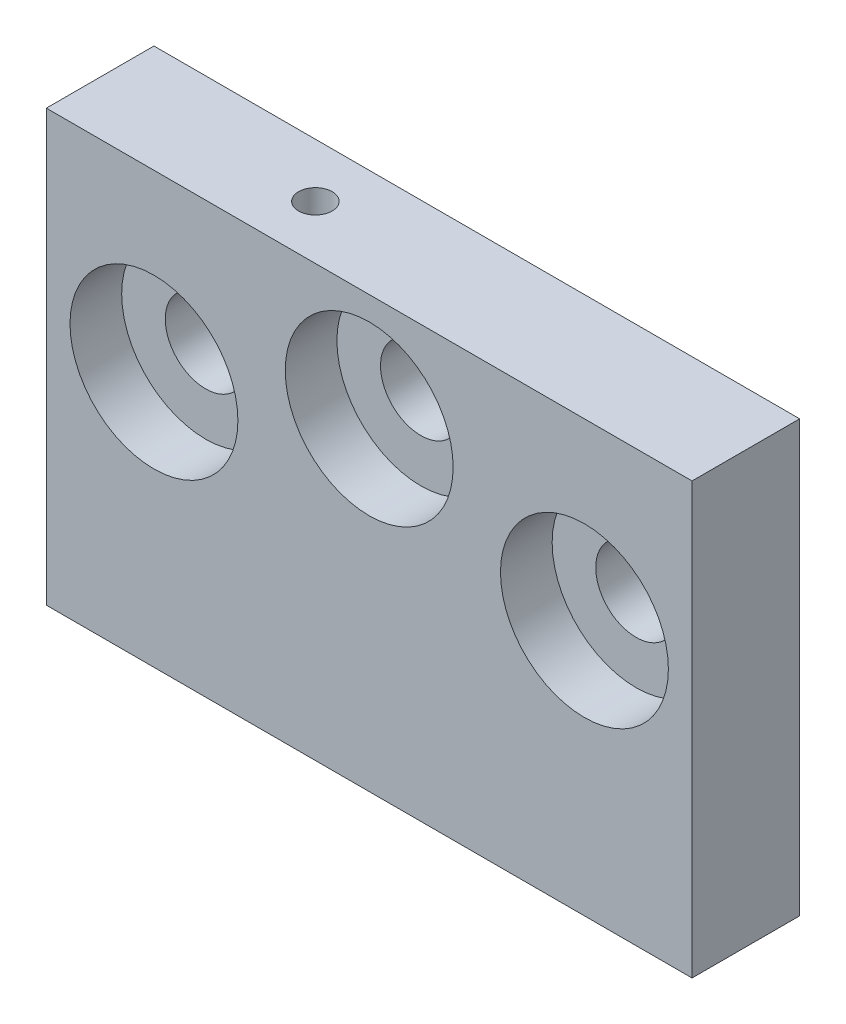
ISO-10303-21;
HEADER;
FILE_DESCRIPTION(('STEP AP214'),'2;1');
FILE_NAME('part.step','',(''),(''),'','','');
FILE_SCHEMA(('AUTOMOTIVE_DESIGN { 1 0 10303 214 1 1 1 1 }'));
ENDSEC;
DATA;
#1=APPLICATION_CONTEXT('core data for automotive mechanical design processes');
#2=APPLICATION_PROTOCOL_DEFINITION('international standard','automotive_design',2000,#1);
#3=PRODUCT_CONTEXT('',#1,'mechanical');
#4=PRODUCT('Part','Part','',(#3));
#5=PRODUCT_RELATED_PRODUCT_CATEGORY('part','',(#4));
#6=PRODUCT_DEFINITION_FORMATION('','',#4);
#7=PRODUCT_DEFINITION_CONTEXT('part definition',#1,'design');
#8=PRODUCT_DEFINITION('design','',#6,#7);
#9=PRODUCT_DEFINITION_SHAPE('','',#8);
#10=(LENGTH_UNIT() NAMED_UNIT(*) SI_UNIT(.MILLI.,.METRE.));
#11=(NAMED_UNIT(*) PLANE_ANGLE_UNIT() SI_UNIT($,.RADIAN.));
#12=(NAMED_UNIT(*) SI_UNIT($,.STERADIAN.) SOLID_ANGLE_UNIT());
#13=UNCERTAINTY_MEASURE_WITH_UNIT(LENGTH_MEASURE(1.E-05),#10,'distance_accuracy_value','');
#14=(GEOMETRIC_REPRESENTATION_CONTEXT(3) GLOBAL_UNCERTAINTY_ASSIGNED_CONTEXT((#13)) GLOBAL_UNIT_ASSIGNED_CONTEXT((#10,
#11,#12)) REPRESENTATION_CONTEXT('',''));
#15=CARTESIAN_POINT('',(0.,0.,0.));
#16=DIRECTION('',(0.,0.,1.));
#17=DIRECTION('',(1.,0.,0.));
#18=AXIS2_PLACEMENT_3D('',#15,#16,#17);
#19=CARTESIAN_POINT('',(-12.7,50.8,-6.35));
#20=DIRECTION('',(0.,-1.,0.));
#21=DIRECTION('',(1.,0.,0.));
#22=AXIS2_PLACEMENT_3D('',#19,#20,#21);
#23=CYLINDRICAL_SURFACE('',#22,1.9812);
#24=CARTESIAN_POINT('',(-12.7,25.4,-6.35));
#25=DIRECTION('',(0.,1.,0.));
#26=DIRECTION('',(-1.,0.,0.));
#27=AXIS2_PLACEMENT_3D('',#24,#25,#26);
#28=CIRCLE('',#27,1.9812);
#29=CARTESIAN_POINT('',(-10.7188,25.4,-6.35));
#30=VERTEX_POINT('',#29);
#31=EDGE_CURVE('E135',#30,#30,#28,.T.);
#32=CARTESIAN_POINT('',(-12.7,-9.52499999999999,-6.35));
#33=DIRECTION('',(0.,-1.,0.));
#34=DIRECTION('',(1.,0.,0.));
#35=AXIS2_PLACEMENT_3D('',#32,#33,#34);
#36=CIRCLE('',#35,1.9812);
#37=CARTESIAN_POINT('',(-10.7188,-9.52499999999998,-6.35));
#38=VERTEX_POINT('',#37);
#39=EDGE_CURVE('E37',#38,#38,#36,.F.);
#40=CARTESIAN_POINT('',(-10.7188,25.4,-6.35));
#41=CARTESIAN_POINT('',(-10.7188,25.0361979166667,-6.35));
#42=CARTESIAN_POINT('',(-10.7188,24.6723958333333,-6.35));
#43=CARTESIAN_POINT('',(-10.7188,23.9447916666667,-6.35));
#44=CARTESIAN_POINT('',(-10.7188,23.5809895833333,-6.35));
#45=CARTESIAN_POINT('',(-10.7188,22.8533854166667,-6.35));
#46=CARTESIAN_POINT('',(-10.7188,22.4895833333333,-6.35));
#47=CARTESIAN_POINT('',(-10.7188,21.7619791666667,-6.35));
#48=CARTESIAN_POINT('',(-10.7188,21.3981770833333,-6.35));
#49=CARTESIAN_POINT('',(-10.7188,20.6705729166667,-6.35));
#50=CARTESIAN_POINT('',(-10.7188,20.3067708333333,-6.35));
#51=CARTESIAN_POINT('',(-10.7188,19.5791666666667,-6.35));
#52=CARTESIAN_POINT('',(-10.7188,19.2153645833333,-6.35));
#53=CARTESIAN_POINT('',(-10.7188,18.4877604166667,-6.35));
#54=CARTESIAN_POINT('',(-10.7188,18.1239583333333,-6.35));
#55=CARTESIAN_POINT('',(-10.7188,17.3963541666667,-6.35));
#56=CARTESIAN_POINT('',(-10.7188,17.0325520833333,-6.35));
#57=CARTESIAN_POINT('',(-10.7188,16.3049479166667,-6.35));
#58=CARTESIAN_POINT('',(-10.7188,15.9411458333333,-6.35));
#59=CARTESIAN_POINT('',(-10.7188,15.2135416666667,-6.35));
#60=CARTESIAN_POINT('',(-10.7188,14.8497395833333,-6.35));
#61=CARTESIAN_POINT('',(-10.7188,14.1221354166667,-6.35));
#62=CARTESIAN_POINT('',(-10.7188,13.7583333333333,-6.35));
#63=CARTESIAN_POINT('',(-10.7188,13.0307291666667,-6.35));
#64=CARTESIAN_POINT('',(-10.7188,12.6669270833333,-6.35));
#65=CARTESIAN_POINT('',(-10.7188,11.9393229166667,-6.35));
#66=CARTESIAN_POINT('',(-10.7188,11.5755208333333,-6.35));
#67=CARTESIAN_POINT('',(-10.7188,10.8479166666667,-6.35));
#68=CARTESIAN_POINT('',(-10.7188,10.4841145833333,-6.35));
#69=CARTESIAN_POINT('',(-10.7188,9.75651041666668,-6.35));
#70=CARTESIAN_POINT('',(-10.7188,9.39270833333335,-6.35));
#71=CARTESIAN_POINT('',(-10.7188,8.66510416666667,-6.35));
#72=CARTESIAN_POINT('',(-10.7188,8.30130208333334,-6.35));
#73=CARTESIAN_POINT('',(-10.7188,7.57369791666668,-6.35));
#74=CARTESIAN_POINT('',(-10.7188,7.20989583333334,-6.35));
#75=CARTESIAN_POINT('',(-10.7188,6.48229166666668,-6.35));
#76=CARTESIAN_POINT('',(-10.7188,6.11848958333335,-6.35));
#77=CARTESIAN_POINT('',(-10.7188,5.39088541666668,-6.35));
#78=CARTESIAN_POINT('',(-10.7188,5.02708333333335,-6.35));
#79=CARTESIAN_POINT('',(-10.7188,4.29947916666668,-6.35));
#80=CARTESIAN_POINT('',(-10.7188,3.93567708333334,-6.35));
#81=CARTESIAN_POINT('',(-10.7188,3.20807291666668,-6.35));
#82=CARTESIAN_POINT('',(-10.7188,2.84427083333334,-6.35));
#83=CARTESIAN_POINT('',(-10.7188,2.11666666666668,-6.35));
#84=CARTESIAN_POINT('',(-10.7188,1.75286458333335,-6.35));
#85=CARTESIAN_POINT('',(-10.7188,1.02526041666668,-6.35));
#86=CARTESIAN_POINT('',(-10.7188,0.661458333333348,-6.35));
#87=CARTESIAN_POINT('',(-10.7188,-0.0661458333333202,-6.35));
#88=CARTESIAN_POINT('',(-10.7188,-0.429947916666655,-6.35));
#89=CARTESIAN_POINT('',(-10.7188,-1.15755208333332,-6.35));
#90=CARTESIAN_POINT('',(-10.7188,-1.52135416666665,-6.35));
#91=CARTESIAN_POINT('',(-10.7188,-2.24895833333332,-6.35));
#92=CARTESIAN_POINT('',(-10.7188,-2.61276041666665,-6.35));
#93=CARTESIAN_POINT('',(-10.7188,-3.34036458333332,-6.35));
#94=CARTESIAN_POINT('',(-10.7188,-3.70416666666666,-6.35));
#95=CARTESIAN_POINT('',(-10.7188,-4.43177083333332,-6.35));
#96=CARTESIAN_POINT('',(-10.7188,-4.79557291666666,-6.35));
#97=CARTESIAN_POINT('',(-10.7188,-5.52317708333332,-6.35));
#98=CARTESIAN_POINT('',(-10.7188,-5.88697916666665,-6.35));
#99=CARTESIAN_POINT('',(-10.7188,-6.61458333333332,-6.35));
#100=CARTESIAN_POINT('',(-10.7188,-6.97838541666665,-6.35));
#101=CARTESIAN_POINT('',(-10.7188,-7.70598958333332,-6.35));
#102=CARTESIAN_POINT('',(-10.7188,-8.06979166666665,-6.35));
#103=CARTESIAN_POINT('',(-10.7188,-8.79739583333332,-6.35));
#104=CARTESIAN_POINT('',(-10.7188,-9.16119791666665,-6.35));
#105=CARTESIAN_POINT('',(-10.7188,-9.52499999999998,-6.35));
#106=B_SPLINE_CURVE_WITH_KNOTS('',3,(#40,#41,#42,#43,#44,#45,#46,#47,#48,#49,#50,#51,#52,#53,
#54,#55,#56,#57,#58,#59,#60,#61,#62,#63,#64,#65,#66,#67,#68,#69,#70,#71,#72,#73,#74,#75,#76,#77,
#78,#79,#80,#81,#82,#83,#84,#85,#86,#87,#88,#89,#90,#91,#92,#93,#94,#95,#96,#97,#98,#99,#100,
#101,#102,#103,#104,#105),.UNSPECIFIED.,.F.,.F.,(4,2,2,2,2,2,2,2,2,2,2,2,2,2,2,2,2,2,2,2,2,2,2,
2,2,2,2,2,2,2,2,2,4),(0.,1.09140625,2.1828125,3.27421875,4.365625,5.45703125,6.54843749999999,
7.63984375,8.73124999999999,9.82265625,10.9140625,12.00546875,13.096875,14.18828125,15.2796875,
16.37109375,17.4625,18.55390625,19.6453125,20.73671875,21.828125,22.91953125,24.0109375,
25.10234375,26.19375,27.28515625,28.3765625,29.46796875,30.559375,31.65078125,32.7421875,
33.83359375,34.925),.UNSPECIFIED.);
#107=EDGE_CURVE('BSEAM33',#30,#38,#106,.T.);
#108=ORIENTED_EDGE('',*,*,#31,.T.);
#109=ORIENTED_EDGE('',*,*,#39,.F.);
#110=ORIENTED_EDGE('',*,*,#107,.T.);
#111=ORIENTED_EDGE('',*,*,#107,.F.);
#112=EDGE_LOOP('',(#108,#110,#109,#111));
#113=FACE_BOUND('',#112,.T.);
#114=ADVANCED_FACE('F33',(#113),#23,.F.);
#115=CARTESIAN_POINT('',(25.4,4.7752,-12.7));
#116=DIRECTION('',(0.,0.,1.));
#117=DIRECTION('',(1.,0.,0.));
#118=AXIS2_PLACEMENT_3D('',#115,#116,#117);
#119=CYLINDRICAL_SURFACE('',#118,4.7625);
#120=CARTESIAN_POINT('',(25.4,4.7752,-12.7));
#121=DIRECTION('',(0.,0.,1.));
#122=DIRECTION('',(1.,0.,0.));
#123=AXIS2_PLACEMENT_3D('',#120,#121,#122);
#124=CIRCLE('',#123,4.7625);
#125=CARTESIAN_POINT('',(30.1625,4.7752,-12.7));
#126=VERTEX_POINT('',#125);
#127=EDGE_CURVE('E115',#126,#126,#124,.T.);
#128=ORIENTED_EDGE('',*,*,#127,.F.);
#129=EDGE_LOOP('',(#128));
#130=FACE_BOUND('',#129,.T.);
#131=CARTESIAN_POINT('',(25.4,4.7752,-6.096));
#132=DIRECTION('',(0.,0.,1.));
#133=DIRECTION('',(1.,0.,0.));
#134=AXIS2_PLACEMENT_3D('',#131,#132,#133);
#135=CIRCLE('',#134,4.7625);
#136=CARTESIAN_POINT('',(30.1625,4.7752,-6.096));
#137=VERTEX_POINT('',#136);
#138=EDGE_CURVE('E121',#137,#137,#135,.F.);
#139=ORIENTED_EDGE('',*,*,#138,.F.);
#140=EDGE_LOOP('',(#139));
#141=FACE_BOUND('',#140,.T.);
#142=ADVANCED_FACE('F178',(#130,#141),#119,.F.);
#143=CARTESIAN_POINT('',(0.,12.7,-12.7));
#144=DIRECTION('',(0.,0.,1.));
#145=DIRECTION('',(1.,0.,0.));
#146=AXIS2_PLACEMENT_3D('',#143,#144,#145);
#147=CYLINDRICAL_SURFACE('',#146,4.7625);
#148=CARTESIAN_POINT('',(0.,12.7,-12.7));
#149=DIRECTION('',(0.,0.,1.));
#150=DIRECTION('',(1.,0.,0.));
#151=AXIS2_PLACEMENT_3D('',#148,#149,#150);
#152=CIRCLE('',#151,4.7625);
#153=CARTESIAN_POINT('',(4.7625,12.7,-12.7));
#154=VERTEX_POINT('',#153);
#155=EDGE_CURVE('E148',#154,#154,#152,.T.);
#156=ORIENTED_EDGE('',*,*,#155,.F.);
#157=EDGE_LOOP('',(#156));
#158=FACE_BOUND('',#157,.T.);
#159=CARTESIAN_POINT('',(0.,12.7,-6.096));
#160=DIRECTION('',(0.,0.,1.));
#161=DIRECTION('',(1.,0.,0.));
#162=AXIS2_PLACEMENT_3D('',#159,#160,#161);
#163=CIRCLE('',#162,4.7625);
#164=CARTESIAN_POINT('',(4.7625,12.7,-6.096));
#165=VERTEX_POINT('',#164);
#166=EDGE_CURVE('E117',#165,#165,#163,.F.);
#167=ORIENTED_EDGE('',*,*,#166,.F.);
#168=EDGE_LOOP('',(#167));
#169=FACE_BOUND('',#168,.T.);
#170=ADVANCED_FACE('F157',(#158,#169),#147,.F.);
#171=CARTESIAN_POINT('',(-25.4,4.7752,-12.7));
#172=DIRECTION('',(0.,0.,1.));
#173=DIRECTION('',(1.,0.,0.));
#174=AXIS2_PLACEMENT_3D('',#171,#172,#173);
#175=CYLINDRICAL_SURFACE('',#174,4.7625);
#176=CARTESIAN_POINT('',(-25.4,4.7752,-12.7));
#177=DIRECTION('',(0.,0.,1.));
#178=DIRECTION('',(1.,0.,0.));
#179=AXIS2_PLACEMENT_3D('',#176,#177,#178);
#180=CIRCLE('',#179,4.7625);
#181=CARTESIAN_POINT('',(-20.6375,4.7752,-12.7));
#182=VERTEX_POINT('',#181);
#183=EDGE_CURVE('E105',#182,#182,#180,.T.);
#184=ORIENTED_EDGE('',*,*,#183,.F.);
#185=EDGE_LOOP('',(#184));
#186=FACE_BOUND('',#185,.T.);
#187=CARTESIAN_POINT('',(-25.4,4.7752,-6.096));
#188=DIRECTION('',(0.,0.,1.));
#189=DIRECTION('',(1.,0.,0.));
#190=AXIS2_PLACEMENT_3D('',#187,#188,#189);
#191=CIRCLE('',#190,4.7625);
#192=CARTESIAN_POINT('',(-20.6375,4.7752,-6.096));
#193=VERTEX_POINT('',#192);
#194=EDGE_CURVE('E112',#193,#193,#191,.F.);
#195=ORIENTED_EDGE('',*,*,#194,.F.);
#196=EDGE_LOOP('',(#195));
#197=FACE_BOUND('',#196,.T.);
#198=ADVANCED_FACE('F154',(#186,#197),#175,.F.);
#199=CARTESIAN_POINT('',(38.1,25.4,-12.7));
#200=DIRECTION('',(0.,1.,0.));
#201=DIRECTION('',(-1.,0.,0.));
#202=AXIS2_PLACEMENT_3D('',#199,#200,#201);
#203=PLANE('',#202);
#204=ORIENTED_EDGE('',*,*,#31,.F.);
#205=EDGE_LOOP('',(#204));
#206=FACE_BOUND('',#205,.T.);
#207=DIRECTION('',(-1.,0.,0.));
#208=VECTOR('',#207,1.);
#209=CARTESIAN_POINT('',(38.1,25.4,0.));
#210=LINE('',#209,#208);
#211=CARTESIAN_POINT('',(38.1,25.4,0.));
#212=VERTEX_POINT('',#211);
#213=CARTESIAN_POINT('',(-38.1,25.4,0.));
#214=VERTEX_POINT('',#213);
#215=EDGE_CURVE('E101',#212,#214,#210,.T.);
#216=ORIENTED_EDGE('',*,*,#215,.F.);
#217=DIRECTION('',(0.,0.,1.));
#218=VECTOR('',#217,1.);
#219=CARTESIAN_POINT('',(38.1,25.4,-12.7));
#220=LINE('',#219,#218);
#221=CARTESIAN_POINT('',(38.1,25.4,-12.7));
#222=VERTEX_POINT('',#221);
#223=EDGE_CURVE('E11',#222,#212,#220,.T.);
#224=ORIENTED_EDGE('',*,*,#223,.F.);
#225=DIRECTION('',(-1.,0.,0.));
#226=VECTOR('',#225,1.);
#227=CARTESIAN_POINT('',(38.1,25.4,-12.7));
#228=LINE('',#227,#226);
#229=CARTESIAN_POINT('',(-38.1,25.4,-12.7));
#230=VERTEX_POINT('',#229);
#231=EDGE_CURVE('E94',#222,#230,#228,.T.);
#232=ORIENTED_EDGE('',*,*,#231,.T.);
#233=DIRECTION('',(0.,0.,1.));
#234=VECTOR('',#233,1.);
#235=CARTESIAN_POINT('',(-38.1,25.4,-12.7));
#236=LINE('',#235,#234);
#237=EDGE_CURVE('E77',#230,#214,#236,.T.);
#238=ORIENTED_EDGE('',*,*,#237,.T.);
#239=EDGE_LOOP('',(#216,#224,#232,#238));
#240=FACE_BOUND('',#239,.T.);
#241=ADVANCED_FACE('F35',(#206,#240),#203,.T.);
#242=CARTESIAN_POINT('',(38.1,25.4,-12.7));
#243=DIRECTION('',(1.,0.,0.));
#244=DIRECTION('',(0.,1.,0.));
#245=AXIS2_PLACEMENT_3D('',#242,#243,#244);
#246=PLANE('',#245);
#247=DIRECTION('',(0.,1.,0.));
#248=VECTOR('',#247,1.);
#249=CARTESIAN_POINT('',(38.1,25.4,0.));
#250=LINE('',#249,#248);
#251=CARTESIAN_POINT('',(38.1,-25.4,0.));
#252=VERTEX_POINT('',#251);
#253=EDGE_CURVE('E96',#252,#212,#250,.T.);
#254=ORIENTED_EDGE('',*,*,#253,.F.);
#255=DIRECTION('',(0.,0.,1.));
#256=VECTOR('',#255,1.);
#257=CARTESIAN_POINT('',(38.1,-25.4,-12.7));
#258=LINE('',#257,#256);
#259=CARTESIAN_POINT('',(38.1,-25.4,-12.7));
#260=VERTEX_POINT('',#259);
#261=EDGE_CURVE('E43',#260,#252,#258,.T.);
#262=ORIENTED_EDGE('',*,*,#261,.F.);
#263=DIRECTION('',(0.,1.,0.));
#264=VECTOR('',#263,1.);
#265=CARTESIAN_POINT('',(38.1,25.4,-12.7));
#266=LINE('',#265,#264);
#267=EDGE_CURVE('E91',#260,#222,#266,.T.);
#268=ORIENTED_EDGE('',*,*,#267,.T.);
#269=ORIENTED_EDGE('',*,*,#223,.T.);
#270=EDGE_LOOP('',(#254,#262,#268,#269));
#271=FACE_BOUND('',#270,.T.);
#272=ADVANCED_FACE('F214',(#271),#246,.T.);
#273=CARTESIAN_POINT('',(38.1,-25.4,-12.7));
#274=DIRECTION('',(0.,-1.,0.));
#275=DIRECTION('',(1.,0.,0.));
#276=AXIS2_PLACEMENT_3D('',#273,#274,#275);
#277=PLANE('',#276);
#278=CARTESIAN_POINT('',(-12.7,-25.4,-6.35));
#279=DIRECTION('',(0.,-1.,0.));
#280=DIRECTION('',(1.,0.,0.));
#281=AXIS2_PLACEMENT_3D('',#278,#279,#280);
#282=CIRCLE('',#281,2.9718);
#283=CARTESIAN_POINT('',(-9.72820000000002,-25.4,-6.35));
#284=VERTEX_POINT('',#283);
#285=EDGE_CURVE('E295',#284,#284,#282,.T.);
#286=ORIENTED_EDGE('',*,*,#285,.F.);
#287=EDGE_LOOP('',(#286));
#288=FACE_BOUND('',#287,.T.);
#289=DIRECTION('',(1.,0.,0.));
#290=VECTOR('',#289,1.);
#291=CARTESIAN_POINT('',(38.1,-25.4,0.));
#292=LINE('',#291,#290);
#293=CARTESIAN_POINT('',(-38.1,-25.4,0.));
#294=VERTEX_POINT('',#293);
#295=EDGE_CURVE('E85',#294,#252,#292,.T.);
#296=ORIENTED_EDGE('',*,*,#295,.F.);
#297=DIRECTION('',(0.,0.,1.));
#298=VECTOR('',#297,1.);
#299=CARTESIAN_POINT('',(-38.1,-25.4,-12.7));
#300=LINE('',#299,#298);
#301=CARTESIAN_POINT('',(-38.1,-25.4,-12.7));
#302=VERTEX_POINT('',#301);
#303=EDGE_CURVE('E80',#302,#294,#300,.T.);
#304=ORIENTED_EDGE('',*,*,#303,.F.);
#305=DIRECTION('',(1.,0.,0.));
#306=VECTOR('',#305,1.);
#307=CARTESIAN_POINT('',(38.1,-25.4,-12.7));
#308=LINE('',#307,#306);
#309=EDGE_CURVE('E83',#302,#260,#308,.T.);
#310=ORIENTED_EDGE('',*,*,#309,.T.);
#311=ORIENTED_EDGE('',*,*,#261,.T.);
#312=EDGE_LOOP('',(#296,#304,#310,#311));
#313=FACE_BOUND('',#312,.T.);
#314=ADVANCED_FACE('F82',(#288,#313),#277,.T.);
#315=CARTESIAN_POINT('',(-38.1,25.4,-12.7));
#316=DIRECTION('',(-1.,0.,0.));
#317=DIRECTION('',(0.,-1.,0.));
#318=AXIS2_PLACEMENT_3D('',#315,#316,#317);
#319=PLANE('',#318);
#320=DIRECTION('',(0.,-1.,0.));
#321=VECTOR('',#320,1.);
#322=CARTESIAN_POINT('',(-38.1,25.4,0.));
#323=LINE('',#322,#321);
#324=EDGE_CURVE('E104',#214,#294,#323,.T.);
#325=ORIENTED_EDGE('',*,*,#324,.F.);
#326=ORIENTED_EDGE('',*,*,#237,.F.);
#327=DIRECTION('',(0.,-1.,0.));
#328=VECTOR('',#327,1.);
#329=CARTESIAN_POINT('',(-38.1,25.4,-12.7));
#330=LINE('',#329,#328);
#331=EDGE_CURVE('E90',#230,#302,#330,.T.);
#332=ORIENTED_EDGE('',*,*,#331,.T.);
#333=ORIENTED_EDGE('',*,*,#303,.T.);
#334=EDGE_LOOP('',(#325,#326,#332,#333));
#335=FACE_BOUND('',#334,.T.);
#336=ADVANCED_FACE('F93',(#335),#319,.T.);
#337=CARTESIAN_POINT('',(0.,0.,-12.7));
#338=DIRECTION('',(0.,0.,1.));
#339=DIRECTION('',(1.,0.,0.));
#340=AXIS2_PLACEMENT_3D('',#337,#338,#339);
#341=PLANE('',#340);
#342=ORIENTED_EDGE('',*,*,#127,.T.);
#343=EDGE_LOOP('',(#342));
#344=FACE_BOUND('',#343,.T.);
#345=ORIENTED_EDGE('',*,*,#155,.T.);
#346=EDGE_LOOP('',(#345));
#347=FACE_BOUND('',#346,.T.);
#348=ORIENTED_EDGE('',*,*,#183,.T.);
#349=EDGE_LOOP('',(#348));
#350=FACE_BOUND('',#349,.T.);
#351=ORIENTED_EDGE('',*,*,#231,.F.);
#352=ORIENTED_EDGE('',*,*,#267,.F.);
#353=ORIENTED_EDGE('',*,*,#309,.F.);
#354=ORIENTED_EDGE('',*,*,#331,.F.);
#355=EDGE_LOOP('',(#351,#352,#353,#354));
#356=FACE_BOUND('',#355,.T.);
#357=ADVANCED_FACE('F89',(#344,#347,#350,#356),#341,.F.);
#358=CARTESIAN_POINT('',(0.,0.,0.));
#359=DIRECTION('',(0.,0.,1.));
#360=DIRECTION('',(1.,0.,0.));
#361=AXIS2_PLACEMENT_3D('',#358,#359,#360);
#362=PLANE('',#361);
#363=CARTESIAN_POINT('',(25.4,4.7752,0.));
#364=DIRECTION('',(0.,0.,1.));
#365=DIRECTION('',(1.,0.,0.));
#366=AXIS2_PLACEMENT_3D('',#363,#364,#365);
#367=CIRCLE('',#366,9.90600000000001);
#368=CARTESIAN_POINT('',(35.306,4.7752,0.));
#369=VERTEX_POINT('',#368);
#370=EDGE_CURVE('E130',#369,#369,#367,.T.);
#371=ORIENTED_EDGE('',*,*,#370,.F.);
#372=EDGE_LOOP('',(#371));
#373=FACE_BOUND('',#372,.T.);
#374=CARTESIAN_POINT('',(0.,12.7,0.));
#375=DIRECTION('',(0.,0.,1.));
#376=DIRECTION('',(1.,0.,0.));
#377=AXIS2_PLACEMENT_3D('',#374,#375,#376);
#378=CIRCLE('',#377,9.906);
#379=CARTESIAN_POINT('',(9.906,12.7,0.));
#380=VERTEX_POINT('',#379);
#381=EDGE_CURVE('E123',#380,#380,#378,.T.);
#382=ORIENTED_EDGE('',*,*,#381,.F.);
#383=EDGE_LOOP('',(#382));
#384=FACE_BOUND('',#383,.T.);
#385=CARTESIAN_POINT('',(-25.4,4.7752,0.));
#386=DIRECTION('',(0.,0.,1.));
#387=DIRECTION('',(1.,0.,0.));
#388=AXIS2_PLACEMENT_3D('',#385,#386,#387);
#389=CIRCLE('',#388,9.906);
#390=CARTESIAN_POINT('',(-15.494,4.7752,0.));
#391=VERTEX_POINT('',#390);
#392=EDGE_CURVE('E119',#391,#391,#389,.T.);
#393=ORIENTED_EDGE('',*,*,#392,.F.);
#394=EDGE_LOOP('',(#393));
#395=FACE_BOUND('',#394,.T.);
#396=ORIENTED_EDGE('',*,*,#215,.T.);
#397=ORIENTED_EDGE('',*,*,#324,.T.);
#398=ORIENTED_EDGE('',*,*,#295,.T.);
#399=ORIENTED_EDGE('',*,*,#253,.T.);
#400=EDGE_LOOP('',(#396,#397,#398,#399));
#401=FACE_BOUND('',#400,.T.);
#402=ADVANCED_FACE('F164',(#373,#384,#395,#401),#362,.T.);
#403=CARTESIAN_POINT('',(-25.4,4.7752,-6.096));
#404=DIRECTION('',(0.,0.,1.));
#405=DIRECTION('',(1.,0.,0.));
#406=AXIS2_PLACEMENT_3D('',#403,#404,#405);
#407=PLANE('',#406);
#408=CARTESIAN_POINT('',(-25.4,4.7752,-6.096));
#409=DIRECTION('',(0.,0.,1.));
#410=DIRECTION('',(1.,0.,0.));
#411=AXIS2_PLACEMENT_3D('',#408,#409,#410);
#412=CIRCLE('',#411,9.906);
#413=CARTESIAN_POINT('',(-15.494,4.7752,-6.096));
#414=VERTEX_POINT('',#413);
#415=EDGE_CURVE('E116',#414,#414,#412,.T.);
#416=ORIENTED_EDGE('',*,*,#415,.T.);
#417=EDGE_LOOP('',(#416));
#418=FACE_BOUND('',#417,.T.);
#419=ORIENTED_EDGE('',*,*,#194,.T.);
#420=EDGE_LOOP('',(#419));
#421=FACE_BOUND('',#420,.T.);
#422=ADVANCED_FACE('F161',(#418,#421),#407,.T.);
#423=CARTESIAN_POINT('',(-25.4,4.7752,-6.096));
#424=DIRECTION('',(0.,0.,1.));
#425=DIRECTION('',(1.,0.,0.));
#426=AXIS2_PLACEMENT_3D('',#423,#424,#425);
#427=CYLINDRICAL_SURFACE('',#426,9.906);
#428=CARTESIAN_POINT('',(-15.494,4.7752,-6.096));
#429=CARTESIAN_POINT('',(-15.494,4.7752,-6.0325));
#430=CARTESIAN_POINT('',(-15.494,4.7752,-5.969));
#431=CARTESIAN_POINT('',(-15.494,4.7752,-5.842));
#432=CARTESIAN_POINT('',(-15.494,4.7752,-5.7785));
#433=CARTESIAN_POINT('',(-15.494,4.7752,-5.6515));
#434=CARTESIAN_POINT('',(-15.494,4.7752,-5.588));
#435=CARTESIAN_POINT('',(-15.494,4.7752,-5.461));
#436=CARTESIAN_POINT('',(-15.494,4.7752,-5.3975));
#437=CARTESIAN_POINT('',(-15.494,4.7752,-5.2705));
#438=CARTESIAN_POINT('',(-15.494,4.7752,-5.207));
#439=CARTESIAN_POINT('',(-15.494,4.7752,-5.08));
#440=CARTESIAN_POINT('',(-15.494,4.7752,-5.0165));
#441=CARTESIAN_POINT('',(-15.494,4.7752,-4.8895));
#442=CARTESIAN_POINT('',(-15.494,4.7752,-4.826));
#443=CARTESIAN_POINT('',(-15.494,4.7752,-4.699));
#444=CARTESIAN_POINT('',(-15.494,4.7752,-4.6355));
#445=CARTESIAN_POINT('',(-15.494,4.7752,-4.5085));
#446=CARTESIAN_POINT('',(-15.494,4.7752,-4.445));
#447=CARTESIAN_POINT('',(-15.494,4.7752,-4.318));
#448=CARTESIAN_POINT('',(-15.494,4.7752,-4.2545));
#449=CARTESIAN_POINT('',(-15.494,4.7752,-4.1275));
#450=CARTESIAN_POINT('',(-15.494,4.7752,-4.064));
#451=CARTESIAN_POINT('',(-15.494,4.7752,-3.937));
#452=CARTESIAN_POINT('',(-15.494,4.7752,-3.8735));
#453=CARTESIAN_POINT('',(-15.494,4.7752,-3.7465));
#454=CARTESIAN_POINT('',(-15.494,4.7752,-3.683));
#455=CARTESIAN_POINT('',(-15.494,4.7752,-3.556));
#456=CARTESIAN_POINT('',(-15.494,4.7752,-3.4925));
#457=CARTESIAN_POINT('',(-15.494,4.7752,-3.3655));
#458=CARTESIAN_POINT('',(-15.494,4.7752,-3.302));
#459=CARTESIAN_POINT('',(-15.494,4.7752,-3.175));
#460=CARTESIAN_POINT('',(-15.494,4.7752,-3.1115));
#461=CARTESIAN_POINT('',(-15.494,4.7752,-2.9845));
#462=CARTESIAN_POINT('',(-15.494,4.7752,-2.921));
#463=CARTESIAN_POINT('',(-15.494,4.7752,-2.794));
#464=CARTESIAN_POINT('',(-15.494,4.7752,-2.7305));
#465=CARTESIAN_POINT('',(-15.494,4.7752,-2.6035));
#466=CARTESIAN_POINT('',(-15.494,4.7752,-2.54));
#467=CARTESIAN_POINT('',(-15.494,4.7752,-2.413));
#468=CARTESIAN_POINT('',(-15.494,4.7752,-2.3495));
#469=CARTESIAN_POINT('',(-15.494,4.7752,-2.2225));
#470=CARTESIAN_POINT('',(-15.494,4.7752,-2.159));
#471=CARTESIAN_POINT('',(-15.494,4.7752,-2.032));
#472=CARTESIAN_POINT('',(-15.494,4.7752,-1.9685));
#473=CARTESIAN_POINT('',(-15.494,4.7752,-1.8415));
#474=CARTESIAN_POINT('',(-15.494,4.7752,-1.778));
#475=CARTESIAN_POINT('',(-15.494,4.7752,-1.651));
#476=CARTESIAN_POINT('',(-15.494,4.7752,-1.5875));
#477=CARTESIAN_POINT('',(-15.494,4.7752,-1.4605));
#478=CARTESIAN_POINT('',(-15.494,4.7752,-1.397));
#479=CARTESIAN_POINT('',(-15.494,4.7752,-1.27));
#480=CARTESIAN_POINT('',(-15.494,4.7752,-1.2065));
#481=CARTESIAN_POINT('',(-15.494,4.7752,-1.0795));
#482=CARTESIAN_POINT('',(-15.494,4.7752,-1.016));
#483=CARTESIAN_POINT('',(-15.494,4.7752,-0.889));
#484=CARTESIAN_POINT('',(-15.494,4.7752,-0.8255));
#485=CARTESIAN_POINT('',(-15.494,4.7752,-0.6985));
#486=CARTESIAN_POINT('',(-15.494,4.7752,-0.635));
#487=CARTESIAN_POINT('',(-15.494,4.7752,-0.508));
#488=CARTESIAN_POINT('',(-15.494,4.7752,-0.4445));
#489=CARTESIAN_POINT('',(-15.494,4.7752,-0.3175));
#490=CARTESIAN_POINT('',(-15.494,4.7752,-0.254));
#491=CARTESIAN_POINT('',(-15.494,4.7752,-0.127));
#492=CARTESIAN_POINT('',(-15.494,4.7752,-0.0634999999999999));
#493=CARTESIAN_POINT('',(-15.494,4.7752,0.));
#494=B_SPLINE_CURVE_WITH_KNOTS('',3,(#428,#429,#430,#431,#432,#433,#434,#435,#436,#437,#438,
#439,#440,#441,#442,#443,#444,#445,#446,#447,#448,#449,#450,#451,#452,#453,#454,#455,#456,#457,
#458,#459,#460,#461,#462,#463,#464,#465,#466,#467,#468,#469,#470,#471,#472,#473,#474,#475,#476,
#477,#478,#479,#480,#481,#482,#483,#484,#485,#486,#487,#488,#489,#490,#491,#492,#493),
.UNSPECIFIED.,.F.,.F.,(4,2,2,2,2,2,2,2,2,2,2,2,2,2,2,2,2,2,2,2,2,2,2,2,2,2,2,2,2,2,2,2,4),(0.,
0.190500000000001,0.381,0.571500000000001,0.762000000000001,0.9525,1.143,1.3335,1.524,1.7145,
1.905,2.0955,2.286,2.4765,2.667,2.8575,3.048,3.2385,3.429,3.6195,3.81,4.0005,4.191,4.3815,4.572,
4.7625,4.953,5.1435,5.334,5.5245,5.715,5.9055,6.096),.UNSPECIFIED.);
#495=EDGE_CURVE('BSEAM163',#414,#391,#494,.T.);
#496=ORIENTED_EDGE('',*,*,#415,.F.);
#497=ORIENTED_EDGE('',*,*,#392,.T.);
#498=ORIENTED_EDGE('',*,*,#495,.T.);
#499=ORIENTED_EDGE('',*,*,#495,.F.);
#500=EDGE_LOOP('',(#496,#498,#497,#499));
#501=FACE_BOUND('',#500,.T.);
#502=ADVANCED_FACE('F163',(#501),#427,.F.);
#503=CARTESIAN_POINT('',(0.,12.7,-6.096));
#504=DIRECTION('',(0.,0.,1.));
#505=DIRECTION('',(1.,0.,0.));
#506=AXIS2_PLACEMENT_3D('',#503,#504,#505);
#507=PLANE('',#506);
#508=CARTESIAN_POINT('',(0.,12.7,-6.096));
#509=DIRECTION('',(0.,0.,1.));
#510=DIRECTION('',(1.,0.,0.));
#511=AXIS2_PLACEMENT_3D('',#508,#509,#510);
#512=CIRCLE('',#511,9.906);
#513=CARTESIAN_POINT('',(9.906,12.7,-6.096));
#514=VERTEX_POINT('',#513);
#515=EDGE_CURVE('E120',#514,#514,#512,.T.);
#516=ORIENTED_EDGE('',*,*,#515,.T.);
#517=EDGE_LOOP('',(#516));
#518=FACE_BOUND('',#517,.T.);
#519=ORIENTED_EDGE('',*,*,#166,.T.);
#520=EDGE_LOOP('',(#519));
#521=FACE_BOUND('',#520,.T.);
#522=ADVANCED_FACE('F171',(#518,#521),#507,.T.);
#523=CARTESIAN_POINT('',(0.,12.7,-6.096));
#524=DIRECTION('',(0.,0.,1.));
#525=DIRECTION('',(1.,0.,0.));
#526=AXIS2_PLACEMENT_3D('',#523,#524,#525);
#527=CYLINDRICAL_SURFACE('',#526,9.906);
#528=CARTESIAN_POINT('',(9.906,12.7,-6.096));
#529=CARTESIAN_POINT('',(9.906,12.7,-6.0325));
#530=CARTESIAN_POINT('',(9.906,12.7,-5.969));
#531=CARTESIAN_POINT('',(9.906,12.7,-5.842));
#532=CARTESIAN_POINT('',(9.906,12.7,-5.7785));
#533=CARTESIAN_POINT('',(9.906,12.7,-5.6515));
#534=CARTESIAN_POINT('',(9.906,12.7,-5.588));
#535=CARTESIAN_POINT('',(9.906,12.7,-5.461));
#536=CARTESIAN_POINT('',(9.906,12.7,-5.3975));
#537=CARTESIAN_POINT('',(9.906,12.7,-5.2705));
#538=CARTESIAN_POINT('',(9.906,12.7,-5.207));
#539=CARTESIAN_POINT('',(9.906,12.7,-5.08));
#540=CARTESIAN_POINT('',(9.906,12.7,-5.0165));
#541=CARTESIAN_POINT('',(9.906,12.7,-4.8895));
#542=CARTESIAN_POINT('',(9.906,12.7,-4.826));
#543=CARTESIAN_POINT('',(9.906,12.7,-4.699));
#544=CARTESIAN_POINT('',(9.906,12.7,-4.6355));
#545=CARTESIAN_POINT('',(9.906,12.7,-4.5085));
#546=CARTESIAN_POINT('',(9.906,12.7,-4.445));
#547=CARTESIAN_POINT('',(9.906,12.7,-4.318));
#548=CARTESIAN_POINT('',(9.906,12.7,-4.2545));
#549=CARTESIAN_POINT('',(9.906,12.7,-4.1275));
#550=CARTESIAN_POINT('',(9.906,12.7,-4.064));
#551=CARTESIAN_POINT('',(9.906,12.7,-3.937));
#552=CARTESIAN_POINT('',(9.906,12.7,-3.8735));
#553=CARTESIAN_POINT('',(9.906,12.7,-3.7465));
#554=CARTESIAN_POINT('',(9.906,12.7,-3.683));
#555=CARTESIAN_POINT('',(9.906,12.7,-3.556));
#556=CARTESIAN_POINT('',(9.906,12.7,-3.4925));
#557=CARTESIAN_POINT('',(9.906,12.7,-3.3655));
#558=CARTESIAN_POINT('',(9.906,12.7,-3.302));
#559=CARTESIAN_POINT('',(9.906,12.7,-3.175));
#560=CARTESIAN_POINT('',(9.906,12.7,-3.1115));
#561=CARTESIAN_POINT('',(9.906,12.7,-2.9845));
#562=CARTESIAN_POINT('',(9.906,12.7,-2.921));
#563=CARTESIAN_POINT('',(9.906,12.7,-2.794));
#564=CARTESIAN_POINT('',(9.906,12.7,-2.7305));
#565=CARTESIAN_POINT('',(9.906,12.7,-2.6035));
#566=CARTESIAN_POINT('',(9.906,12.7,-2.54));
#567=CARTESIAN_POINT('',(9.906,12.7,-2.413));
#568=CARTESIAN_POINT('',(9.906,12.7,-2.3495));
#569=CARTESIAN_POINT('',(9.906,12.7,-2.2225));
#570=CARTESIAN_POINT('',(9.906,12.7,-2.159));
#571=CARTESIAN_POINT('',(9.906,12.7,-2.032));
#572=CARTESIAN_POINT('',(9.906,12.7,-1.9685));
#573=CARTESIAN_POINT('',(9.906,12.7,-1.8415));
#574=CARTESIAN_POINT('',(9.906,12.7,-1.778));
#575=CARTESIAN_POINT('',(9.906,12.7,-1.651));
#576=CARTESIAN_POINT('',(9.906,12.7,-1.5875));
#577=CARTESIAN_POINT('',(9.906,12.7,-1.4605));
#578=CARTESIAN_POINT('',(9.906,12.7,-1.397));
#579=CARTESIAN_POINT('',(9.906,12.7,-1.27));
#580=CARTESIAN_POINT('',(9.906,12.7,-1.2065));
#581=CARTESIAN_POINT('',(9.906,12.7,-1.0795));
#582=CARTESIAN_POINT('',(9.906,12.7,-1.016));
#583=CARTESIAN_POINT('',(9.906,12.7,-0.889));
#584=CARTESIAN_POINT('',(9.906,12.7,-0.8255));
#585=CARTESIAN_POINT('',(9.906,12.7,-0.6985));
#586=CARTESIAN_POINT('',(9.906,12.7,-0.635));
#587=CARTESIAN_POINT('',(9.906,12.7,-0.508));
#588=CARTESIAN_POINT('',(9.906,12.7,-0.4445));
#589=CARTESIAN_POINT('',(9.906,12.7,-0.3175));
#590=CARTESIAN_POINT('',(9.906,12.7,-0.254));
#591=CARTESIAN_POINT('',(9.906,12.7,-0.127));
#592=CARTESIAN_POINT('',(9.906,12.7,-0.0634999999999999));
#593=CARTESIAN_POINT('',(9.906,12.7,0.));
#594=B_SPLINE_CURVE_WITH_KNOTS('',3,(#528,#529,#530,#531,#532,#533,#534,#535,#536,#537,#538,
#539,#540,#541,#542,#543,#544,#545,#546,#547,#548,#549,#550,#551,#552,#553,#554,#555,#556,#557,
#558,#559,#560,#561,#562,#563,#564,#565,#566,#567,#568,#569,#570,#571,#572,#573,#574,#575,#576,
#577,#578,#579,#580,#581,#582,#583,#584,#585,#586,#587,#588,#589,#590,#591,#592,#593),
.UNSPECIFIED.,.F.,.F.,(4,2,2,2,2,2,2,2,2,2,2,2,2,2,2,2,2,2,2,2,2,2,2,2,2,2,2,2,2,2,2,2,4),(0.,
0.190500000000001,0.381,0.571500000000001,0.762000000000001,0.9525,1.143,1.3335,1.524,1.7145,
1.905,2.0955,2.286,2.4765,2.667,2.8575,3.048,3.2385,3.429,3.6195,3.81,4.0005,4.191,4.3815,4.572,
4.7625,4.953,5.1435,5.334,5.5245,5.715,5.9055,6.096),.UNSPECIFIED.);
#595=EDGE_CURVE('BSEAM196',#514,#380,#594,.T.);
#596=ORIENTED_EDGE('',*,*,#515,.F.);
#597=ORIENTED_EDGE('',*,*,#381,.T.);
#598=ORIENTED_EDGE('',*,*,#595,.T.);
#599=ORIENTED_EDGE('',*,*,#595,.F.);
#600=EDGE_LOOP('',(#596,#598,#597,#599));
#601=FACE_BOUND('',#600,.T.);
#602=ADVANCED_FACE('F196',(#601),#527,.F.);
#603=CARTESIAN_POINT('',(25.4,4.7752,-6.096));
#604=DIRECTION('',(0.,0.,1.));
#605=DIRECTION('',(1.,0.,0.));
#606=AXIS2_PLACEMENT_3D('',#603,#604,#605);
#607=PLANE('',#606);
#608=CARTESIAN_POINT('',(25.4,4.7752,-6.096));
#609=DIRECTION('',(0.,0.,1.));
#610=DIRECTION('',(1.,0.,0.));
#611=AXIS2_PLACEMENT_3D('',#608,#609,#610);
#612=CIRCLE('',#611,9.90600000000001);
#613=CARTESIAN_POINT('',(35.306,4.7752,-6.096));
#614=VERTEX_POINT('',#613);
#615=EDGE_CURVE('E124',#614,#614,#612,.T.);
#616=ORIENTED_EDGE('',*,*,#615,.T.);
#617=EDGE_LOOP('',(#616));
#618=FACE_BOUND('',#617,.T.);
#619=ORIENTED_EDGE('',*,*,#138,.T.);
#620=EDGE_LOOP('',(#619));
#621=FACE_BOUND('',#620,.T.);
#622=ADVANCED_FACE('F192',(#618,#621),#607,.T.);
#623=CARTESIAN_POINT('',(25.4,4.7752,-6.096));
#624=DIRECTION('',(0.,0.,1.));
#625=DIRECTION('',(1.,0.,0.));
#626=AXIS2_PLACEMENT_3D('',#623,#624,#625);
#627=CYLINDRICAL_SURFACE('',#626,9.90600000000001);
#628=CARTESIAN_POINT('',(35.306,4.7752,-6.096));
#629=CARTESIAN_POINT('',(35.306,4.7752,-6.0325));
#630=CARTESIAN_POINT('',(35.306,4.7752,-5.969));
#631=CARTESIAN_POINT('',(35.306,4.7752,-5.842));
#632=CARTESIAN_POINT('',(35.306,4.7752,-5.7785));
#633=CARTESIAN_POINT('',(35.306,4.7752,-5.6515));
#634=CARTESIAN_POINT('',(35.306,4.7752,-5.588));
#635=CARTESIAN_POINT('',(35.306,4.7752,-5.461));
#636=CARTESIAN_POINT('',(35.306,4.7752,-5.3975));
#637=CARTESIAN_POINT('',(35.306,4.7752,-5.2705));
#638=CARTESIAN_POINT('',(35.306,4.7752,-5.207));
#639=CARTESIAN_POINT('',(35.306,4.7752,-5.08));
#640=CARTESIAN_POINT('',(35.306,4.7752,-5.0165));
#641=CARTESIAN_POINT('',(35.306,4.7752,-4.8895));
#642=CARTESIAN_POINT('',(35.306,4.7752,-4.826));
#643=CARTESIAN_POINT('',(35.306,4.7752,-4.699));
#644=CARTESIAN_POINT('',(35.306,4.7752,-4.6355));
#645=CARTESIAN_POINT('',(35.306,4.7752,-4.5085));
#646=CARTESIAN_POINT('',(35.306,4.7752,-4.445));
#647=CARTESIAN_POINT('',(35.306,4.7752,-4.318));
#648=CARTESIAN_POINT('',(35.306,4.7752,-4.2545));
#649=CARTESIAN_POINT('',(35.306,4.7752,-4.1275));
#650=CARTESIAN_POINT('',(35.306,4.7752,-4.064));
#651=CARTESIAN_POINT('',(35.306,4.7752,-3.937));
#652=CARTESIAN_POINT('',(35.306,4.7752,-3.8735));
#653=CARTESIAN_POINT('',(35.306,4.7752,-3.7465));
#654=CARTESIAN_POINT('',(35.306,4.7752,-3.683));
#655=CARTESIAN_POINT('',(35.306,4.7752,-3.556));
#656=CARTESIAN_POINT('',(35.306,4.7752,-3.4925));
#657=CARTESIAN_POINT('',(35.306,4.7752,-3.3655));
#658=CARTESIAN_POINT('',(35.306,4.7752,-3.302));
#659=CARTESIAN_POINT('',(35.306,4.7752,-3.175));
#660=CARTESIAN_POINT('',(35.306,4.7752,-3.1115));
#661=CARTESIAN_POINT('',(35.306,4.7752,-2.9845));
#662=CARTESIAN_POINT('',(35.306,4.7752,-2.921));
#663=CARTESIAN_POINT('',(35.306,4.7752,-2.794));
#664=CARTESIAN_POINT('',(35.306,4.7752,-2.7305));
#665=CARTESIAN_POINT('',(35.306,4.7752,-2.6035));
#666=CARTESIAN_POINT('',(35.306,4.7752,-2.54));
#667=CARTESIAN_POINT('',(35.306,4.7752,-2.413));
#668=CARTESIAN_POINT('',(35.306,4.7752,-2.3495));
#669=CARTESIAN_POINT('',(35.306,4.7752,-2.2225));
#670=CARTESIAN_POINT('',(35.306,4.7752,-2.159));
#671=CARTESIAN_POINT('',(35.306,4.7752,-2.032));
#672=CARTESIAN_POINT('',(35.306,4.7752,-1.9685));
#673=CARTESIAN_POINT('',(35.306,4.7752,-1.8415));
#674=CARTESIAN_POINT('',(35.306,4.7752,-1.778));
#675=CARTESIAN_POINT('',(35.306,4.7752,-1.651));
#676=CARTESIAN_POINT('',(35.306,4.7752,-1.5875));
#677=CARTESIAN_POINT('',(35.306,4.7752,-1.4605));
#678=CARTESIAN_POINT('',(35.306,4.7752,-1.397));
#679=CARTESIAN_POINT('',(35.306,4.7752,-1.27));
#680=CARTESIAN_POINT('',(35.306,4.7752,-1.2065));
#681=CARTESIAN_POINT('',(35.306,4.7752,-1.0795));
#682=CARTESIAN_POINT('',(35.306,4.7752,-1.016));
#683=CARTESIAN_POINT('',(35.306,4.7752,-0.889));
#684=CARTESIAN_POINT('',(35.306,4.7752,-0.8255));
#685=CARTESIAN_POINT('',(35.306,4.7752,-0.6985));
#686=CARTESIAN_POINT('',(35.306,4.7752,-0.635));
#687=CARTESIAN_POINT('',(35.306,4.7752,-0.508));
#688=CARTESIAN_POINT('',(35.306,4.7752,-0.4445));
#689=CARTESIAN_POINT('',(35.306,4.7752,-0.3175));
#690=CARTESIAN_POINT('',(35.306,4.7752,-0.254));
#691=CARTESIAN_POINT('',(35.306,4.7752,-0.127));
#692=CARTESIAN_POINT('',(35.306,4.7752,-0.0634999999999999));
#693=CARTESIAN_POINT('',(35.306,4.7752,0.));
#694=B_SPLINE_CURVE_WITH_KNOTS('',3,(#628,#629,#630,#631,#632,#633,#634,#635,#636,#637,#638,
#639,#640,#641,#642,#643,#644,#645,#646,#647,#648,#649,#650,#651,#652,#653,#654,#655,#656,#657,
#658,#659,#660,#661,#662,#663,#664,#665,#666,#667,#668,#669,#670,#671,#672,#673,#674,#675,#676,
#677,#678,#679,#680,#681,#682,#683,#684,#685,#686,#687,#688,#689,#690,#691,#692,#693),
.UNSPECIFIED.,.F.,.F.,(4,2,2,2,2,2,2,2,2,2,2,2,2,2,2,2,2,2,2,2,2,2,2,2,2,2,2,2,2,2,2,2,4),(0.,
0.190500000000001,0.381,0.571500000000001,0.762000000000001,0.9525,1.143,1.3335,1.524,1.7145,
1.905,2.0955,2.286,2.4765,2.667,2.8575,3.048,3.2385,3.429,3.6195,3.81,4.0005,4.191,4.3815,4.572,
4.7625,4.953,5.1435,5.334,5.5245,5.715,5.9055,6.096),.UNSPECIFIED.);
#695=EDGE_CURVE('BSEAM195',#614,#369,#694,.T.);
#696=ORIENTED_EDGE('',*,*,#615,.F.);
#697=ORIENTED_EDGE('',*,*,#370,.T.);
#698=ORIENTED_EDGE('',*,*,#695,.T.);
#699=ORIENTED_EDGE('',*,*,#695,.F.);
#700=EDGE_LOOP('',(#696,#698,#697,#699));
#701=FACE_BOUND('',#700,.T.);
#702=ADVANCED_FACE('F195',(#701),#627,.F.);
#703=CARTESIAN_POINT('',(-12.7,-9.525,-6.35));
#704=DIRECTION('',(0.,-1.,0.));
#705=DIRECTION('',(1.,0.,0.));
#706=AXIS2_PLACEMENT_3D('',#703,#704,#705);
#707=PLANE('',#706);
#708=CARTESIAN_POINT('',(-12.7,-9.525,-6.35));
#709=DIRECTION('',(0.,-1.,0.));
#710=DIRECTION('',(1.,0.,0.));
#711=AXIS2_PLACEMENT_3D('',#708,#709,#710);
#712=CIRCLE('',#711,2.9718);
#713=CARTESIAN_POINT('',(-9.72820000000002,-9.525,-6.35));
#714=VERTEX_POINT('',#713);
#715=EDGE_CURVE('E292',#714,#714,#712,.T.);
#716=ORIENTED_EDGE('',*,*,#715,.T.);
#717=EDGE_LOOP('',(#716));
#718=FACE_BOUND('',#717,.T.);
#719=ORIENTED_EDGE('',*,*,#39,.T.);
#720=EDGE_LOOP('',(#719));
#721=FACE_BOUND('',#720,.T.);
#722=ADVANCED_FACE('F199',(#718,#721),#707,.T.);
#723=CARTESIAN_POINT('',(-12.7,-9.525,-6.35));
#724=DIRECTION('',(0.,-1.,0.));
#725=DIRECTION('',(1.,0.,0.));
#726=AXIS2_PLACEMENT_3D('',#723,#724,#725);
#727=CYLINDRICAL_SURFACE('',#726,2.9718);
#728=ORIENTED_EDGE('',*,*,#715,.F.);
#729=EDGE_LOOP('',(#728));
#730=FACE_BOUND('',#729,.T.);
#731=ORIENTED_EDGE('',*,*,#285,.T.);
#732=EDGE_LOOP('',(#731));
#733=FACE_BOUND('',#732,.T.);
#734=ADVANCED_FACE('F190',(#730,#733),#727,.F.);
#735=CLOSED_SHELL('',(#114,#142,#170,#198,#241,#272,#314,#336,#357,#402,#422,#502,#522,#602,
#622,#702,#722,#734));
#736=MANIFOLD_SOLID_BREP('B2',#735);
#737=ADVANCED_BREP_SHAPE_REPRESENTATION('',(#18,#736),#14);
#738=SHAPE_DEFINITION_REPRESENTATION(#9,#737);
ENDSEC;
END-ISO-10303-21;
